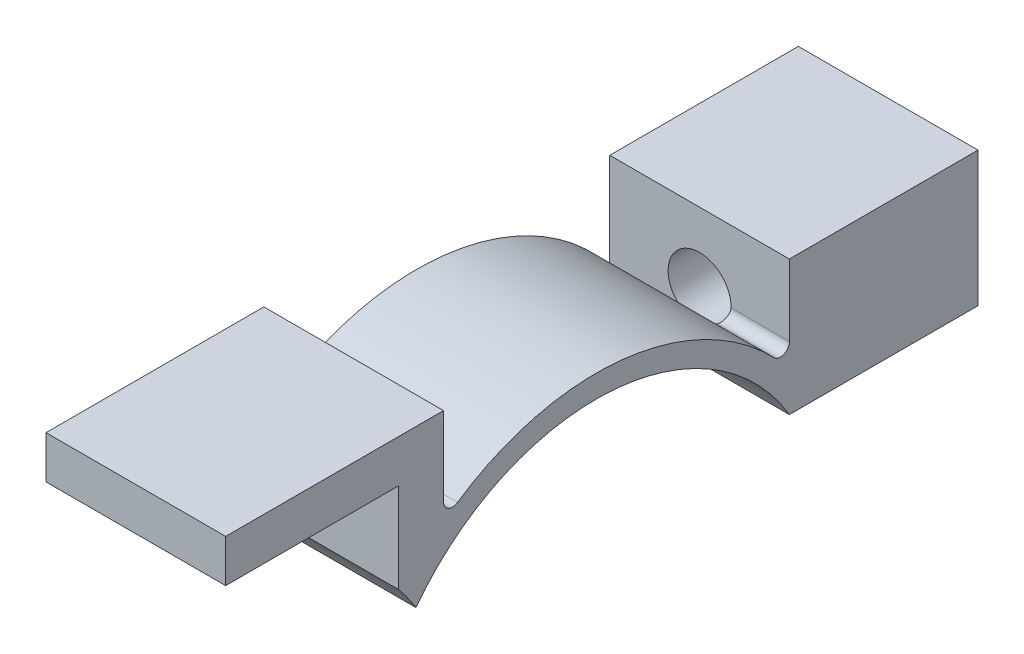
ISO-10303-21;
HEADER;
FILE_DESCRIPTION(('STEP AP214'),'2;1');
FILE_NAME('part.step','',(''),(''),'','','');
FILE_SCHEMA(('AUTOMOTIVE_DESIGN { 1 0 10303 214 1 1 1 1 }'));
ENDSEC;
DATA;
#1=APPLICATION_CONTEXT('core data for automotive mechanical design processes');
#2=APPLICATION_PROTOCOL_DEFINITION('international standard','automotive_design',2000,#1);
#3=PRODUCT_CONTEXT('',#1,'mechanical');
#4=PRODUCT('Part','Part','',(#3));
#5=PRODUCT_RELATED_PRODUCT_CATEGORY('part','',(#4));
#6=PRODUCT_DEFINITION_FORMATION('','',#4);
#7=PRODUCT_DEFINITION_CONTEXT('part definition',#1,'design');
#8=PRODUCT_DEFINITION('design','',#6,#7);
#9=PRODUCT_DEFINITION_SHAPE('','',#8);
#10=(LENGTH_UNIT() NAMED_UNIT(*) SI_UNIT(.MILLI.,.METRE.));
#11=(NAMED_UNIT(*) PLANE_ANGLE_UNIT() SI_UNIT($,.RADIAN.));
#12=(NAMED_UNIT(*) SI_UNIT($,.STERADIAN.) SOLID_ANGLE_UNIT());
#13=UNCERTAINTY_MEASURE_WITH_UNIT(LENGTH_MEASURE(1.E-05),#10,'distance_accuracy_value','');
#14=(GEOMETRIC_REPRESENTATION_CONTEXT(3) GLOBAL_UNCERTAINTY_ASSIGNED_CONTEXT((#13)) GLOBAL_UNIT_ASSIGNED_CONTEXT((#10,
#11,#12)) REPRESENTATION_CONTEXT('',''));
#15=CARTESIAN_POINT('',(0.,0.,0.));
#16=DIRECTION('',(0.,0.,1.));
#17=DIRECTION('',(1.,0.,0.));
#18=AXIS2_PLACEMENT_3D('',#15,#16,#17);
#19=CARTESIAN_POINT('',(10.16,0.,0.));
#20=DIRECTION('',(1.,0.,0.));
#21=DIRECTION('',(0.,0.,-1.));
#22=AXIS2_PLACEMENT_3D('',#19,#20,#21);
#23=PLANE('',#22);
#24=DIRECTION('',(0.,0.,1.));
#25=VECTOR('',#24,1.);
#26=CARTESIAN_POINT('',(10.16,14.097,-27.94));
#27=LINE('',#26,#25);
#28=CARTESIAN_POINT('',(10.16,14.097,-27.94));
#29=VERTEX_POINT('',#28);
#30=CARTESIAN_POINT('',(10.16,14.097,-17.2742148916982));
#31=VERTEX_POINT('',#30);
#32=EDGE_CURVE('E204',#29,#31,#27,.T.);
#33=ORIENTED_EDGE('',*,*,#32,.T.);
#34=DIRECTION('',(0.,-1.,0.));
#35=VECTOR('',#34,1.);
#36=CARTESIAN_POINT('',(10.16,0.,-17.2742148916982));
#37=LINE('',#36,#35);
#38=CARTESIAN_POINT('',(10.16,10.055593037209,-17.2742148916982));
#39=VERTEX_POINT('',#38);
#40=EDGE_CURVE('E99',#31,#39,#37,.T.);
#41=ORIENTED_EDGE('',*,*,#40,.T.);
#42=CARTESIAN_POINT('',(10.16,10.055593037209,-16.7662148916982));
#43=DIRECTION('',(1.,0.,0.));
#44=DIRECTION('',(0.,0.,-1.));
#45=AXIS2_PLACEMENT_3D('',#42,#43,#44);
#46=CIRCLE('',#45,0.508);
#47=CARTESIAN_POINT('',(10.16,9.70276521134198,-16.4007336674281));
#48=VERTEX_POINT('',#47);
#49=EDGE_CURVE('E14',#39,#48,#46,.F.);
#50=ORIENTED_EDGE('',*,*,#49,.T.);
#51=CARTESIAN_POINT('',(10.16,0.,-6.35));
#52=DIRECTION('',(1.,0.,0.));
#53=DIRECTION('',(0.,0.,-1.));
#54=AXIS2_PLACEMENT_3D('',#51,#52,#53);
#55=CIRCLE('',#54,13.97);
#56=CARTESIAN_POINT('',(10.16,11.5607645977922,1.49280701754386));
#57=VERTEX_POINT('',#56);
#58=EDGE_CURVE('E238',#48,#57,#55,.T.);
#59=ORIENTED_EDGE('',*,*,#58,.T.);
#60=CARTESIAN_POINT('',(10.16,11.9811560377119,1.778));
#61=DIRECTION('',(1.,0.,0.));
#62=DIRECTION('',(0.,0.,-1.));
#63=AXIS2_PLACEMENT_3D('',#60,#61,#62);
#64=CIRCLE('',#63,0.508);
#65=CARTESIAN_POINT('',(10.16,11.9811560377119,2.286));
#66=VERTEX_POINT('',#65);
#67=EDGE_CURVE('E335',#57,#66,#64,.F.);
#68=ORIENTED_EDGE('',*,*,#67,.T.);
#69=DIRECTION('',(0.,-1.,0.));
#70=VECTOR('',#69,1.);
#71=CARTESIAN_POINT('',(10.16,0.,2.286));
#72=LINE('',#71,#70);
#73=CARTESIAN_POINT('',(10.16,16.4521529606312,2.286));
#74=VERTEX_POINT('',#73);
#75=EDGE_CURVE('E254',#74,#66,#72,.T.);
#76=ORIENTED_EDGE('',*,*,#75,.F.);
#77=DIRECTION('',(0.,0.,-1.));
#78=VECTOR('',#77,1.);
#79=CARTESIAN_POINT('',(10.16,16.4521529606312,0.));
#80=LINE('',#79,#78);
#81=CARTESIAN_POINT('',(10.16,16.4521529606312,14.605));
#82=VERTEX_POINT('',#81);
#83=EDGE_CURVE('E259',#82,#74,#80,.T.);
#84=ORIENTED_EDGE('',*,*,#83,.F.);
#85=DIRECTION('',(0.,1.,0.));
#86=VECTOR('',#85,1.);
#87=CARTESIAN_POINT('',(10.16,0.,14.605));
#88=LINE('',#87,#86);
#89=CARTESIAN_POINT('',(10.16,14.0391529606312,14.605));
#90=VERTEX_POINT('',#89);
#91=EDGE_CURVE('E263',#90,#82,#88,.T.);
#92=ORIENTED_EDGE('',*,*,#91,.F.);
#93=DIRECTION('',(0.,0.,1.));
#94=VECTOR('',#93,1.);
#95=CARTESIAN_POINT('',(10.16,14.0391529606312,0.));
#96=LINE('',#95,#94);
#97=CARTESIAN_POINT('',(10.16,14.0391529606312,4.826));
#98=VERTEX_POINT('',#97);
#99=EDGE_CURVE('E267',#98,#90,#96,.T.);
#100=ORIENTED_EDGE('',*,*,#99,.F.);
#101=DIRECTION('',(0.,1.,0.));
#102=VECTOR('',#101,1.);
#103=CARTESIAN_POINT('',(10.16,0.,4.826));
#104=LINE('',#103,#102);
#105=CARTESIAN_POINT('',(10.16,8.95777734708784,4.826));
#106=VERTEX_POINT('',#105);
#107=EDGE_CURVE('E233',#106,#98,#104,.T.);
#108=ORIENTED_EDGE('',*,*,#107,.F.);
#109=CARTESIAN_POINT('',(10.16,0.,15.875));
#110=DIRECTION('',(1.,0.,0.));
#111=DIRECTION('',(0.,0.,-1.));
#112=AXIS2_PLACEMENT_3D('',#109,#110,#111);
#113=CIRCLE('',#112,14.224);
#114=CARTESIAN_POINT('',(10.16,7.58065315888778,3.83939142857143));
#115=VERTEX_POINT('',#114);
#116=EDGE_CURVE('E242',#115,#106,#113,.T.);
#117=ORIENTED_EDGE('',*,*,#116,.F.);
#118=CARTESIAN_POINT('',(10.16,0.,-6.35));
#119=DIRECTION('',(1.,0.,0.));
#120=DIRECTION('',(0.,0.,-1.));
#121=AXIS2_PLACEMENT_3D('',#118,#119,#120);
#122=CIRCLE('',#121,12.7);
#123=CARTESIAN_POINT('',(10.16,6.477,-17.2742148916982));
#124=VERTEX_POINT('',#123);
#125=EDGE_CURVE('E247',#124,#115,#122,.T.);
#126=ORIENTED_EDGE('',*,*,#125,.F.);
#127=DIRECTION('',(0.,0.,1.));
#128=VECTOR('',#127,1.);
#129=CARTESIAN_POINT('',(10.16,6.477,0.));
#130=LINE('',#129,#128);
#131=CARTESIAN_POINT('',(10.16,6.477,-27.94));
#132=VERTEX_POINT('',#131);
#133=EDGE_CURVE('E217',#132,#124,#130,.T.);
#134=ORIENTED_EDGE('',*,*,#133,.F.);
#135=DIRECTION('',(0.,-1.,0.));
#136=VECTOR('',#135,1.);
#137=CARTESIAN_POINT('',(10.16,6.477,-27.94));
#138=LINE('',#137,#136);
#139=EDGE_CURVE('E391',#29,#132,#138,.T.);
#140=ORIENTED_EDGE('',*,*,#139,.F.);
#141=EDGE_LOOP('',(#33,#41,#50,#59,#68,#76,#84,#92,#100,#108,#117,#126,#134,#140));
#142=FACE_BOUND('',#141,.T.);
#143=ADVANCED_FACE('F84',(#142),#23,.T.);
#144=CARTESIAN_POINT('',(0.,0.,0.));
#145=DIRECTION('',(1.,0.,0.));
#146=DIRECTION('',(0.,0.,-1.));
#147=AXIS2_PLACEMENT_3D('',#144,#145,#146);
#148=PLANE('',#147);
#149=DIRECTION('',(0.,-1.,0.));
#150=VECTOR('',#149,1.);
#151=CARTESIAN_POINT('',(0.,0.,-17.2742148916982));
#152=LINE('',#151,#150);
#153=CARTESIAN_POINT('',(0.,14.097,-17.2742148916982));
#154=VERTEX_POINT('',#153);
#155=CARTESIAN_POINT('',(0.,8.70760753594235,-17.2742148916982));
#156=VERTEX_POINT('',#155);
#157=EDGE_CURVE('E209',#154,#156,#152,.T.);
#158=ORIENTED_EDGE('',*,*,#157,.F.);
#159=DIRECTION('',(0.,0.,1.));
#160=VECTOR('',#159,1.);
#161=CARTESIAN_POINT('',(0.,14.097,-27.94));
#162=LINE('',#161,#160);
#163=CARTESIAN_POINT('',(0.,14.097,-27.94));
#164=VERTEX_POINT('',#163);
#165=EDGE_CURVE('E194',#164,#154,#162,.T.);
#166=ORIENTED_EDGE('',*,*,#165,.F.);
#167=DIRECTION('',(0.,1.,0.));
#168=VECTOR('',#167,1.);
#169=CARTESIAN_POINT('',(0.,6.477,-27.94));
#170=LINE('',#169,#168);
#171=CARTESIAN_POINT('',(0.,6.477,-27.94));
#172=VERTEX_POINT('',#171);
#173=EDGE_CURVE('E397',#172,#164,#170,.T.);
#174=ORIENTED_EDGE('',*,*,#173,.F.);
#175=DIRECTION('',(0.,0.,1.));
#176=VECTOR('',#175,1.);
#177=CARTESIAN_POINT('',(0.,6.477,0.));
#178=LINE('',#177,#176);
#179=CARTESIAN_POINT('',(0.,6.477,-17.2742148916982));
#180=VERTEX_POINT('',#179);
#181=EDGE_CURVE('E226',#172,#180,#178,.T.);
#182=ORIENTED_EDGE('',*,*,#181,.T.);
#183=CARTESIAN_POINT('',(0.,0.,-6.35));
#184=DIRECTION('',(1.,0.,0.));
#185=DIRECTION('',(0.,0.,-1.));
#186=AXIS2_PLACEMENT_3D('',#183,#184,#185);
#187=CIRCLE('',#186,12.7);
#188=CARTESIAN_POINT('',(0.,7.58065315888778,3.83939142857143));
#189=VERTEX_POINT('',#188);
#190=EDGE_CURVE('E229',#180,#189,#187,.T.);
#191=ORIENTED_EDGE('',*,*,#190,.T.);
#192=CARTESIAN_POINT('',(0.,0.,15.875));
#193=DIRECTION('',(1.,0.,0.));
#194=DIRECTION('',(0.,0.,-1.));
#195=AXIS2_PLACEMENT_3D('',#192,#193,#194);
#196=CIRCLE('',#195,14.224);
#197=CARTESIAN_POINT('',(0.,8.95777734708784,4.826));
#198=VERTEX_POINT('',#197);
#199=EDGE_CURVE('E234',#189,#198,#196,.T.);
#200=ORIENTED_EDGE('',*,*,#199,.T.);
#201=DIRECTION('',(0.,1.,0.));
#202=VECTOR('',#201,1.);
#203=CARTESIAN_POINT('',(0.,0.,4.826));
#204=LINE('',#203,#202);
#205=CARTESIAN_POINT('',(0.,14.0391529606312,4.826));
#206=VERTEX_POINT('',#205);
#207=EDGE_CURVE('E237',#198,#206,#204,.T.);
#208=ORIENTED_EDGE('',*,*,#207,.T.);
#209=DIRECTION('',(0.,0.,1.));
#210=VECTOR('',#209,1.);
#211=CARTESIAN_POINT('',(0.,14.0391529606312,0.));
#212=LINE('',#211,#210);
#213=CARTESIAN_POINT('',(0.,14.0391529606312,14.605));
#214=VERTEX_POINT('',#213);
#215=EDGE_CURVE('E361',#206,#214,#212,.T.);
#216=ORIENTED_EDGE('',*,*,#215,.T.);
#217=DIRECTION('',(0.,1.,0.));
#218=VECTOR('',#217,1.);
#219=CARTESIAN_POINT('',(0.,0.,14.605));
#220=LINE('',#219,#218);
#221=CARTESIAN_POINT('',(0.,16.4521529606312,14.605));
#222=VERTEX_POINT('',#221);
#223=EDGE_CURVE('E364',#214,#222,#220,.T.);
#224=ORIENTED_EDGE('',*,*,#223,.T.);
#225=DIRECTION('',(0.,0.,-1.));
#226=VECTOR('',#225,1.);
#227=CARTESIAN_POINT('',(0.,16.4521529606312,0.));
#228=LINE('',#227,#226);
#229=CARTESIAN_POINT('',(0.,16.4521529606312,2.286));
#230=VERTEX_POINT('',#229);
#231=EDGE_CURVE('E367',#222,#230,#228,.T.);
#232=ORIENTED_EDGE('',*,*,#231,.T.);
#233=DIRECTION('',(0.,-1.,0.));
#234=VECTOR('',#233,1.);
#235=CARTESIAN_POINT('',(0.,0.,2.286));
#236=LINE('',#235,#234);
#237=CARTESIAN_POINT('',(0.,11.9811560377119,2.286));
#238=VERTEX_POINT('',#237);
#239=EDGE_CURVE('E230',#230,#238,#236,.T.);
#240=ORIENTED_EDGE('',*,*,#239,.T.);
#241=CARTESIAN_POINT('',(0.,11.9811560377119,1.778));
#242=DIRECTION('',(1.,0.,0.));
#243=DIRECTION('',(0.,0.,-1.));
#244=AXIS2_PLACEMENT_3D('',#241,#242,#243);
#245=CIRCLE('',#244,0.508);
#246=CARTESIAN_POINT('',(0.,11.5607645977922,1.49280701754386));
#247=VERTEX_POINT('',#246);
#248=EDGE_CURVE('E337',#238,#247,#245,.T.);
#249=ORIENTED_EDGE('',*,*,#248,.T.);
#250=CARTESIAN_POINT('',(0.,0.,-6.35));
#251=DIRECTION('',(1.,0.,0.));
#252=DIRECTION('',(0.,0.,-1.));
#253=AXIS2_PLACEMENT_3D('',#250,#251,#252);
#254=CIRCLE('',#253,13.97);
#255=EDGE_CURVE('E216',#156,#247,#254,.T.);
#256=ORIENTED_EDGE('',*,*,#255,.F.);
#257=EDGE_LOOP('',(#158,#166,#174,#182,#191,#200,#208,#216,#224,#232,#240,#249,#256));
#258=FACE_BOUND('',#257,.T.);
#259=ADVANCED_FACE('F214',(#258),#148,.F.);
#260=CARTESIAN_POINT('',(48.9302192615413,0.,4.826));
#261=DIRECTION('',(0.,0.,1.));
#262=DIRECTION('',(1.,0.,0.));
#263=AXIS2_PLACEMENT_3D('',#260,#261,#262);
#264=PLANE('',#263);
#265=DIRECTION('',(-1.,0.,0.));
#266=VECTOR('',#265,1.);
#267=CARTESIAN_POINT('',(48.9302192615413,8.95777734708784,4.826));
#268=LINE('',#267,#266);
#269=EDGE_CURVE('E245',#106,#198,#268,.T.);
#270=ORIENTED_EDGE('',*,*,#269,.F.);
#271=ORIENTED_EDGE('',*,*,#107,.T.);
#272=DIRECTION('',(-1.,0.,0.));
#273=VECTOR('',#272,1.);
#274=CARTESIAN_POINT('',(48.9302192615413,14.0391529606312,4.826));
#275=LINE('',#274,#273);
#276=EDGE_CURVE('E241',#98,#206,#275,.T.);
#277=ORIENTED_EDGE('',*,*,#276,.T.);
#278=ORIENTED_EDGE('',*,*,#207,.F.);
#279=EDGE_LOOP('',(#270,#271,#277,#278));
#280=FACE_BOUND('',#279,.T.);
#281=ADVANCED_FACE('F316',(#280),#264,.T.);
#282=CARTESIAN_POINT('',(48.9302192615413,14.0391529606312,0.));
#283=DIRECTION('',(0.,-1.,0.));
#284=DIRECTION('',(0.,0.,-1.));
#285=AXIS2_PLACEMENT_3D('',#282,#283,#284);
#286=PLANE('',#285);
#287=ORIENTED_EDGE('',*,*,#276,.F.);
#288=ORIENTED_EDGE('',*,*,#99,.T.);
#289=DIRECTION('',(-1.,0.,0.));
#290=VECTOR('',#289,1.);
#291=CARTESIAN_POINT('',(48.9302192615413,14.0391529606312,14.605));
#292=LINE('',#291,#290);
#293=EDGE_CURVE('E266',#90,#214,#292,.T.);
#294=ORIENTED_EDGE('',*,*,#293,.T.);
#295=ORIENTED_EDGE('',*,*,#215,.F.);
#296=EDGE_LOOP('',(#287,#288,#294,#295));
#297=FACE_BOUND('',#296,.T.);
#298=ADVANCED_FACE('F312',(#297),#286,.T.);
#299=CARTESIAN_POINT('',(48.9302192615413,0.,14.605));
#300=DIRECTION('',(0.,0.,1.));
#301=DIRECTION('',(1.,0.,0.));
#302=AXIS2_PLACEMENT_3D('',#299,#300,#301);
#303=PLANE('',#302);
#304=ORIENTED_EDGE('',*,*,#293,.F.);
#305=ORIENTED_EDGE('',*,*,#91,.T.);
#306=DIRECTION('',(-1.,0.,0.));
#307=VECTOR('',#306,1.);
#308=CARTESIAN_POINT('',(48.9302192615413,16.4521529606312,14.605));
#309=LINE('',#308,#307);
#310=EDGE_CURVE('E262',#82,#222,#309,.T.);
#311=ORIENTED_EDGE('',*,*,#310,.T.);
#312=ORIENTED_EDGE('',*,*,#223,.F.);
#313=EDGE_LOOP('',(#304,#305,#311,#312));
#314=FACE_BOUND('',#313,.T.);
#315=ADVANCED_FACE('F308',(#314),#303,.T.);
#316=CARTESIAN_POINT('',(48.9302192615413,16.4521529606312,0.));
#317=DIRECTION('',(0.,1.,0.));
#318=DIRECTION('',(0.,0.,1.));
#319=AXIS2_PLACEMENT_3D('',#316,#317,#318);
#320=PLANE('',#319);
#321=ORIENTED_EDGE('',*,*,#310,.F.);
#322=ORIENTED_EDGE('',*,*,#83,.T.);
#323=DIRECTION('',(-1.,0.,0.));
#324=VECTOR('',#323,1.);
#325=CARTESIAN_POINT('',(48.9302192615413,16.4521529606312,2.286));
#326=LINE('',#325,#324);
#327=EDGE_CURVE('E258',#74,#230,#326,.T.);
#328=ORIENTED_EDGE('',*,*,#327,.T.);
#329=ORIENTED_EDGE('',*,*,#231,.F.);
#330=EDGE_LOOP('',(#321,#322,#328,#329));
#331=FACE_BOUND('',#330,.T.);
#332=ADVANCED_FACE('F304',(#331),#320,.T.);
#333=CARTESIAN_POINT('',(48.9302192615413,0.,2.286));
#334=DIRECTION('',(0.,0.,-1.));
#335=DIRECTION('',(-1.,0.,0.));
#336=AXIS2_PLACEMENT_3D('',#333,#334,#335);
#337=PLANE('',#336);
#338=ORIENTED_EDGE('',*,*,#75,.T.);
#339=DIRECTION('',(-1.,0.,0.));
#340=VECTOR('',#339,1.);
#341=CARTESIAN_POINT('',(48.9302192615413,11.9811560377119,2.286));
#342=LINE('',#341,#340);
#343=EDGE_CURVE('E278',#66,#238,#342,.T.);
#344=ORIENTED_EDGE('',*,*,#343,.T.);
#345=ORIENTED_EDGE('',*,*,#239,.F.);
#346=ORIENTED_EDGE('',*,*,#327,.F.);
#347=EDGE_LOOP('',(#338,#344,#345,#346));
#348=FACE_BOUND('',#347,.T.);
#349=ADVANCED_FACE('F299',(#348),#337,.T.);
#350=CARTESIAN_POINT('',(48.9302192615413,0.,-6.35));
#351=DIRECTION('',(-1.,0.,0.));
#352=DIRECTION('',(0.,0.,1.));
#353=AXIS2_PLACEMENT_3D('',#350,#351,#352);
#354=CYLINDRICAL_SURFACE('',#353,13.97);
#355=ORIENTED_EDGE('',*,*,#255,.T.);
#356=DIRECTION('',(-1.,0.,0.));
#357=VECTOR('',#356,1.);
#358=CARTESIAN_POINT('',(48.9302192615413,11.5607645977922,1.49280701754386));
#359=LINE('',#358,#357);
#360=EDGE_CURVE('E336',#247,#57,#359,.F.);
#361=ORIENTED_EDGE('',*,*,#360,.T.);
#362=ORIENTED_EDGE('',*,*,#58,.F.);
#363=DIRECTION('',(-1.,0.,0.));
#364=VECTOR('',#363,1.);
#365=CARTESIAN_POINT('',(48.9302192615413,9.70276521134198,-16.4007336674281));
#366=LINE('',#365,#364);
#367=CARTESIAN_POINT('',(6.8125626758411,9.70276521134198,-16.4007336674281));
#368=VERTEX_POINT('',#367);
#369=EDGE_CURVE('E288',#48,#368,#366,.T.);
#370=ORIENTED_EDGE('',*,*,#369,.T.);
#371=CARTESIAN_POINT('',(6.8125626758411,9.70276521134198,-16.4007336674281));
#372=CARTESIAN_POINT('',(6.80004076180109,9.6485097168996,-16.453114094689));
#373=CARTESIAN_POINT('',(6.78484032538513,9.59416219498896,-16.5047261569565));
#374=CARTESIAN_POINT('',(6.74865957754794,9.48558404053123,-16.6062239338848));
#375=CARTESIAN_POINT('',(6.7276683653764,9.4313538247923,-16.6561061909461));
#376=CARTESIAN_POINT('',(6.6569401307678,9.27292428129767,-16.7995703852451));
#377=CARTESIAN_POINT('',(6.59871279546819,9.16958881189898,-16.8902340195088));
#378=CARTESIAN_POINT('',(6.48188594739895,9.00566311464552,-17.0301773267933));
#379=CARTESIAN_POINT('',(6.43053854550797,8.94276273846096,-17.0828409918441));
#380=CARTESIAN_POINT('',(6.31585524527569,8.82111173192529,-17.1830666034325));
#381=CARTESIAN_POINT('',(6.2523059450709,8.76246537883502,-17.2305096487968));
#382=CARTESIAN_POINT('',(6.18296285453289,8.70760753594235,-17.2742148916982));
#383=B_SPLINE_CURVE_WITH_KNOTS('',3,(#371,#372,#373,#374,#375,#376,#377,#378,#379,#380,#381,
#382),.UNSPECIFIED.,.F.,.F.,(4,2,2,2,2,4),(0.,0.22922555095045,0.45888558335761,
0.904058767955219,1.19354043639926,1.48864239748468),.UNSPECIFIED.);
#384=CARTESIAN_POINT('',(6.18296285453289,8.70760753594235,-17.2742148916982));
#385=VERTEX_POINT('',#384);
#386=EDGE_CURVE('E281',#368,#385,#383,.T.);
#387=ORIENTED_EDGE('',*,*,#386,.T.);
#388=DIRECTION('',(-1.,0.,0.));
#389=VECTOR('',#388,1.);
#390=CARTESIAN_POINT('',(48.9302192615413,8.70760753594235,-17.2742148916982));
#391=LINE('',#390,#389);
#392=CARTESIAN_POINT('',(3.97703714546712,8.70760753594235,-17.2742148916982));
#393=VERTEX_POINT('',#392);
#394=EDGE_CURVE('E222',#385,#393,#391,.T.);
#395=ORIENTED_EDGE('',*,*,#394,.T.);
#396=EDGE_CURVE('E257',#393,#156,#391,.T.);
#397=ORIENTED_EDGE('',*,*,#396,.T.);
#398=EDGE_LOOP('',(#355,#361,#362,#370,#387,#395,#397));
#399=FACE_BOUND('',#398,.T.);
#400=ADVANCED_FACE('F294',(#399),#354,.T.);
#401=CARTESIAN_POINT('',(48.9302192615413,0.,-17.2742148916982));
#402=DIRECTION('',(0.,0.,-1.));
#403=DIRECTION('',(-1.,0.,0.));
#404=AXIS2_PLACEMENT_3D('',#401,#402,#403);
#405=PLANE('',#404);
#406=ORIENTED_EDGE('',*,*,#40,.F.);
#407=DIRECTION('',(1.,0.,0.));
#408=VECTOR('',#407,1.);
#409=CARTESIAN_POINT('',(10.16,14.097,-17.2742148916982));
#410=LINE('',#409,#408);
#411=EDGE_CURVE('E198',#154,#31,#410,.T.);
#412=ORIENTED_EDGE('',*,*,#411,.F.);
#413=ORIENTED_EDGE('',*,*,#157,.T.);
#414=ORIENTED_EDGE('',*,*,#396,.F.);
#415=CARTESIAN_POINT('',(5.08,10.1021529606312,-17.2742148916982));
#416=DIRECTION('',(0.,0.,-1.));
#417=DIRECTION('',(-1.,0.,0.));
#418=AXIS2_PLACEMENT_3D('',#415,#416,#417);
#419=CIRCLE('',#418,1.778);
#420=CARTESIAN_POINT('',(6.85739027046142,10.055593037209,-17.2742148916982));
#421=VERTEX_POINT('',#420);
#422=EDGE_CURVE('E203',#421,#393,#419,.F.);
#423=ORIENTED_EDGE('',*,*,#422,.F.);
#424=DIRECTION('',(1.,0.,0.));
#425=VECTOR('',#424,1.);
#426=CARTESIAN_POINT('',(10.16,10.055593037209,-17.2742148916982));
#427=LINE('',#426,#425);
#428=EDGE_CURVE('E339',#421,#39,#427,.T.);
#429=ORIENTED_EDGE('',*,*,#428,.T.);
#430=EDGE_LOOP('',(#406,#412,#413,#414,#423,#429));
#431=FACE_BOUND('',#430,.T.);
#432=ADVANCED_FACE('F207',(#431),#405,.F.);
#433=CARTESIAN_POINT('',(48.9302192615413,6.477,0.));
#434=DIRECTION('',(0.,-1.,0.));
#435=DIRECTION('',(0.,0.,-1.));
#436=AXIS2_PLACEMENT_3D('',#433,#434,#435);
#437=PLANE('',#436);
#438=ORIENTED_EDGE('',*,*,#181,.F.);
#439=DIRECTION('',(-1.,0.,0.));
#440=VECTOR('',#439,1.);
#441=CARTESIAN_POINT('',(10.16,6.477,-27.94));
#442=LINE('',#441,#440);
#443=EDGE_CURVE('E394',#132,#172,#442,.T.);
#444=ORIENTED_EDGE('',*,*,#443,.F.);
#445=ORIENTED_EDGE('',*,*,#133,.T.);
#446=DIRECTION('',(-1.,0.,0.));
#447=VECTOR('',#446,1.);
#448=CARTESIAN_POINT('',(48.9302192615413,6.477,-17.2742148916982));
#449=LINE('',#448,#447);
#450=EDGE_CURVE('E220',#124,#180,#449,.T.);
#451=ORIENTED_EDGE('',*,*,#450,.T.);
#452=EDGE_LOOP('',(#438,#444,#445,#451));
#453=FACE_BOUND('',#452,.T.);
#454=ADVANCED_FACE('F395',(#453),#437,.T.);
#455=CARTESIAN_POINT('',(48.9302192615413,0.,-6.35));
#456=DIRECTION('',(-1.,0.,0.));
#457=DIRECTION('',(0.,0.,1.));
#458=AXIS2_PLACEMENT_3D('',#455,#456,#457);
#459=CYLINDRICAL_SURFACE('',#458,12.7);
#460=ORIENTED_EDGE('',*,*,#450,.F.);
#461=ORIENTED_EDGE('',*,*,#125,.T.);
#462=DIRECTION('',(-1.,0.,0.));
#463=VECTOR('',#462,1.);
#464=CARTESIAN_POINT('',(48.9302192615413,7.58065315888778,3.83939142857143));
#465=LINE('',#464,#463);
#466=EDGE_CURVE('E246',#115,#189,#465,.T.);
#467=ORIENTED_EDGE('',*,*,#466,.T.);
#468=ORIENTED_EDGE('',*,*,#190,.F.);
#469=EDGE_LOOP('',(#460,#461,#467,#468));
#470=FACE_BOUND('',#469,.T.);
#471=ADVANCED_FACE('F387',(#470),#459,.F.);
#472=CARTESIAN_POINT('',(48.9302192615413,0.,15.875));
#473=DIRECTION('',(-1.,0.,0.));
#474=DIRECTION('',(0.,0.,1.));
#475=AXIS2_PLACEMENT_3D('',#472,#473,#474);
#476=CYLINDRICAL_SURFACE('',#475,14.224);
#477=ORIENTED_EDGE('',*,*,#466,.F.);
#478=ORIENTED_EDGE('',*,*,#116,.T.);
#479=ORIENTED_EDGE('',*,*,#269,.T.);
#480=ORIENTED_EDGE('',*,*,#199,.F.);
#481=EDGE_LOOP('',(#477,#478,#479,#480));
#482=FACE_BOUND('',#481,.T.);
#483=ADVANCED_FACE('F381',(#482),#476,.F.);
#484=CARTESIAN_POINT('',(48.9302192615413,0.,-17.2742148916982));
#485=DIRECTION('',(0.,0.,-1.));
#486=DIRECTION('',(-1.,0.,0.));
#487=AXIS2_PLACEMENT_3D('',#484,#485,#486);
#488=PLANE('',#487);
#489=ORIENTED_EDGE('',*,*,#394,.F.);
#490=EDGE_CURVE('E251',#393,#385,#419,.F.);
#491=ORIENTED_EDGE('',*,*,#490,.F.);
#492=EDGE_LOOP('',(#489,#491));
#493=FACE_BOUND('',#492,.T.);
#494=ADVANCED_FACE('F331',(#493),#488,.T.);
#495=CARTESIAN_POINT('',(5.08,10.1021529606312,-12.2452714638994));
#496=DIRECTION('',(0.,0.,-1.));
#497=DIRECTION('',(-1.,0.,0.));
#498=AXIS2_PLACEMENT_3D('',#495,#496,#497);
#499=CYLINDRICAL_SURFACE('',#498,1.778);
#500=ORIENTED_EDGE('',*,*,#490,.T.);
#501=ORIENTED_EDGE('',*,*,#386,.F.);
#502=CARTESIAN_POINT('',(6.8125626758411,9.70276521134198,-16.4007336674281));
#503=CARTESIAN_POINT('',(6.80785605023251,9.68235349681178,-16.420414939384));
#504=CARTESIAN_POINT('',(6.80315543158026,9.66360837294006,-16.441833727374));
#505=CARTESIAN_POINT('',(6.79421940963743,9.62987912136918,-16.4875827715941));
#506=CARTESIAN_POINT('',(6.78998464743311,9.61490014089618,-16.5119169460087));
#507=CARTESIAN_POINT('',(6.78244348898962,9.58917070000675,-16.5629126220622));
#508=CARTESIAN_POINT('',(6.77913841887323,9.5784262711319,-16.5895773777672));
#509=CARTESIAN_POINT('',(6.77385265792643,9.56157351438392,-16.6444345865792));
#510=CARTESIAN_POINT('',(6.77187055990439,9.55546025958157,-16.6726253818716));
#511=CARTESIAN_POINT('',(6.76951012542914,9.54820917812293,-16.7287812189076));
#512=CARTESIAN_POINT('',(6.76908221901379,9.54691753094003,-16.7567243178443));
#513=CARTESIAN_POINT('',(6.76974326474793,9.54893254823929,-16.8124317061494));
#514=CARTESIAN_POINT('',(6.7708324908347,9.55224004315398,-16.8401959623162));
#515=CARTESIAN_POINT('',(6.77435440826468,9.56319227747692,-16.8940527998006));
#516=CARTESIAN_POINT('',(6.77675375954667,9.57072950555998,-16.9201696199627));
#517=CARTESIAN_POINT('',(6.78261189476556,9.58980960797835,-16.9707658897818));
#518=CARTESIAN_POINT('',(6.78607076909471,9.60135282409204,-16.9952451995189));
#519=CARTESIAN_POINT('',(6.79381549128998,9.62852295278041,-17.0427029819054));
#520=CARTESIAN_POINT('',(6.79812352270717,9.64426465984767,-17.0656120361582));
#521=CARTESIAN_POINT('',(6.80706189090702,9.67922716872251,-17.1085293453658));
#522=CARTESIAN_POINT('',(6.81169228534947,9.69844859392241,-17.1285370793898));
#523=CARTESIAN_POINT('',(6.82102123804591,9.74074461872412,-17.1659181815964));
#524=CARTESIAN_POINT('',(6.82571498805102,9.76394354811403,-17.1831524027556));
#525=CARTESIAN_POINT('',(6.83451096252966,9.81302331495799,-17.2134913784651));
#526=CARTESIAN_POINT('',(6.83861289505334,9.83890546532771,-17.2265940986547));
#527=CARTESIAN_POINT('',(6.84580529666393,9.89252370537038,-17.2481948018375));
#528=CARTESIAN_POINT('',(6.8489000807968,9.92025125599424,-17.2567125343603));
#529=CARTESIAN_POINT('',(6.8538020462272,9.97681263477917,-17.2688978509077));
#530=CARTESIAN_POINT('',(6.85561258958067,10.0056433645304,-17.2725781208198));
#531=CARTESIAN_POINT('',(6.85698188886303,10.0415697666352,-17.2740704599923));
#532=CARTESIAN_POINT('',(6.85720738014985,10.0485823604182,-17.2742159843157));
#533=CARTESIAN_POINT('',(6.85739027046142,10.055593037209,-17.2742148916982));
#534=B_SPLINE_CURVE_WITH_KNOTS('',3,(#502,#503,#504,#505,#506,#507,#508,#509,#510,#511,#512,
#513,#514,#515,#516,#517,#518,#519,#520,#521,#522,#523,#524,#525,#526,#527,#528,#529,#530,#531,
#532,#533),.UNSPECIFIED.,.F.,.F.,(4,2,2,2,2,2,2,2,2,2,2,2,2,2,2,4),(0.,0.086141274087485,
0.172399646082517,0.258780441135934,0.345069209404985,0.428580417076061,0.512106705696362,
0.593600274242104,0.675100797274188,0.759110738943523,0.843135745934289,0.930556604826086,
1.01802044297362,1.1051044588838,1.19195964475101,1.21300567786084),.UNSPECIFIED.);
#535=EDGE_CURVE('E93',#368,#421,#534,.T.);
#536=ORIENTED_EDGE('',*,*,#535,.T.);
#537=ORIENTED_EDGE('',*,*,#422,.T.);
#538=EDGE_LOOP('',(#500,#501,#536,#537));
#539=FACE_BOUND('',#538,.T.);
#540=CARTESIAN_POINT('',(5.08,10.1021529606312,-27.94));
#541=DIRECTION('',(0.,0.,-1.));
#542=DIRECTION('',(-1.,0.,0.));
#543=AXIS2_PLACEMENT_3D('',#540,#541,#542);
#544=CIRCLE('',#543,1.778);
#545=CARTESIAN_POINT('',(3.302,10.1021529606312,-27.94));
#546=VERTEX_POINT('',#545);
#547=EDGE_CURVE('E211',#546,#546,#544,.T.);
#548=ORIENTED_EDGE('',*,*,#547,.T.);
#549=EDGE_LOOP('',(#548));
#550=FACE_BOUND('',#549,.T.);
#551=ADVANCED_FACE('F290',(#539,#550),#499,.F.);
#552=CARTESIAN_POINT('',(48.9302192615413,11.9811560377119,1.778));
#553=DIRECTION('',(-1.,0.,0.));
#554=DIRECTION('',(0.,0.,1.));
#555=AXIS2_PLACEMENT_3D('',#552,#553,#554);
#556=CYLINDRICAL_SURFACE('',#555,0.508);
#557=ORIENTED_EDGE('',*,*,#67,.F.);
#558=ORIENTED_EDGE('',*,*,#360,.F.);
#559=ORIENTED_EDGE('',*,*,#248,.F.);
#560=ORIENTED_EDGE('',*,*,#343,.F.);
#561=EDGE_LOOP('',(#557,#558,#559,#560));
#562=FACE_BOUND('',#561,.T.);
#563=ADVANCED_FACE('F322',(#562),#556,.F.);
#564=CARTESIAN_POINT('',(48.9302192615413,10.055593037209,-16.7662148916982));
#565=DIRECTION('',(-1.,0.,0.));
#566=DIRECTION('',(0.,0.,1.));
#567=AXIS2_PLACEMENT_3D('',#564,#565,#566);
#568=CYLINDRICAL_SURFACE('',#567,0.508);
#569=ORIENTED_EDGE('',*,*,#49,.F.);
#570=ORIENTED_EDGE('',*,*,#428,.F.);
#571=ORIENTED_EDGE('',*,*,#535,.F.);
#572=ORIENTED_EDGE('',*,*,#369,.F.);
#573=EDGE_LOOP('',(#569,#570,#571,#572));
#574=FACE_BOUND('',#573,.T.);
#575=ADVANCED_FACE('F86',(#574),#568,.F.);
#576=CARTESIAN_POINT('',(0.,0.,-27.94));
#577=DIRECTION('',(0.,0.,1.));
#578=DIRECTION('',(1.,0.,0.));
#579=AXIS2_PLACEMENT_3D('',#576,#577,#578);
#580=PLANE('',#579);
#581=ORIENTED_EDGE('',*,*,#139,.T.);
#582=ORIENTED_EDGE('',*,*,#443,.T.);
#583=ORIENTED_EDGE('',*,*,#173,.T.);
#584=DIRECTION('',(1.,0.,0.));
#585=VECTOR('',#584,1.);
#586=CARTESIAN_POINT('',(10.16,14.097,-27.94));
#587=LINE('',#586,#585);
#588=EDGE_CURVE('E199',#164,#29,#587,.T.);
#589=ORIENTED_EDGE('',*,*,#588,.T.);
#590=EDGE_LOOP('',(#581,#582,#583,#589));
#591=FACE_BOUND('',#590,.T.);
#592=ORIENTED_EDGE('',*,*,#547,.F.);
#593=EDGE_LOOP('',(#592));
#594=FACE_BOUND('',#593,.T.);
#595=ADVANCED_FACE('F329',(#591,#594),#580,.F.);
#596=CARTESIAN_POINT('',(10.16,14.097,-27.94));
#597=DIRECTION('',(0.,-1.,0.));
#598=DIRECTION('',(0.,0.,-1.));
#599=AXIS2_PLACEMENT_3D('',#596,#597,#598);
#600=PLANE('',#599);
#601=ORIENTED_EDGE('',*,*,#165,.T.);
#602=ORIENTED_EDGE('',*,*,#411,.T.);
#603=ORIENTED_EDGE('',*,*,#32,.F.);
#604=ORIENTED_EDGE('',*,*,#588,.F.);
#605=EDGE_LOOP('',(#601,#602,#603,#604));
#606=FACE_BOUND('',#605,.T.);
#607=ADVANCED_FACE('F196',(#606),#600,.F.);
#608=CLOSED_SHELL('',(#143,#259,#281,#298,#315,#332,#349,#400,#432,#454,#471,#483,#494,#551,
#563,#575,#595,#607));
#609=MANIFOLD_SOLID_BREP('B2',#608);
#610=ADVANCED_BREP_SHAPE_REPRESENTATION('',(#18,#609),#14);
#611=SHAPE_DEFINITION_REPRESENTATION(#9,#610);
ENDSEC;
END-ISO-10303-21;
